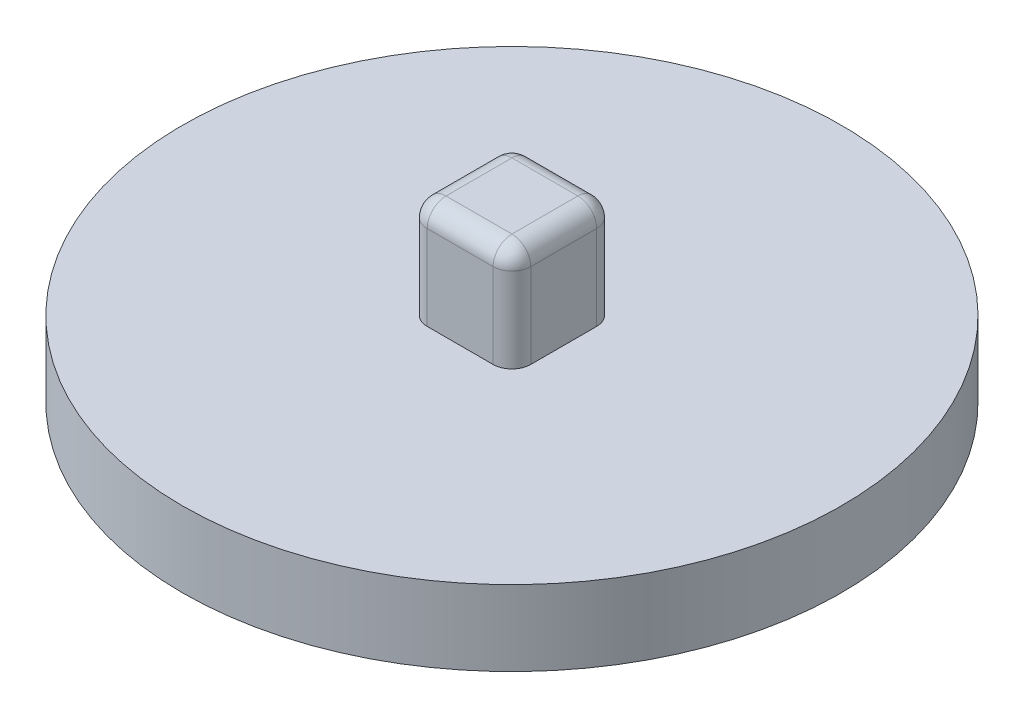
ISO-10303-21;
HEADER;
FILE_DESCRIPTION(('STEP AP214'),'2;1');
FILE_NAME('part.step','',(''),(''),'','','');
FILE_SCHEMA(('AUTOMOTIVE_DESIGN { 1 0 10303 214 1 1 1 1 }'));
ENDSEC;
DATA;
#1=APPLICATION_CONTEXT('core data for automotive mechanical design processes');
#2=APPLICATION_PROTOCOL_DEFINITION('international standard','automotive_design',2000,#1);
#3=PRODUCT_CONTEXT('',#1,'mechanical');
#4=PRODUCT('Part','Part','',(#3));
#5=PRODUCT_RELATED_PRODUCT_CATEGORY('part','',(#4));
#6=PRODUCT_DEFINITION_FORMATION('','',#4);
#7=PRODUCT_DEFINITION_CONTEXT('part definition',#1,'design');
#8=PRODUCT_DEFINITION('design','',#6,#7);
#9=PRODUCT_DEFINITION_SHAPE('','',#8);
#10=(LENGTH_UNIT() NAMED_UNIT(*) SI_UNIT(.MILLI.,.METRE.));
#11=(NAMED_UNIT(*) PLANE_ANGLE_UNIT() SI_UNIT($,.RADIAN.));
#12=(NAMED_UNIT(*) SI_UNIT($,.STERADIAN.) SOLID_ANGLE_UNIT());
#13=UNCERTAINTY_MEASURE_WITH_UNIT(LENGTH_MEASURE(1.E-05),#10,'distance_accuracy_value','');
#14=(GEOMETRIC_REPRESENTATION_CONTEXT(3) GLOBAL_UNCERTAINTY_ASSIGNED_CONTEXT((#13)) GLOBAL_UNIT_ASSIGNED_CONTEXT((#10,
#11,#12)) REPRESENTATION_CONTEXT('',''));
#15=CARTESIAN_POINT('',(0.,0.,0.));
#16=DIRECTION('',(0.,0.,1.));
#17=DIRECTION('',(1.,0.,0.));
#18=AXIS2_PLACEMENT_3D('',#15,#16,#17);
#19=CARTESIAN_POINT('',(0.,8.,0.));
#20=DIRECTION('',(0.,-1.,0.));
#21=DIRECTION('',(0.,0.,-1.));
#22=AXIS2_PLACEMENT_3D('',#19,#20,#21);
#23=CYLINDRICAL_SURFACE('',#22,35.);
#24=CARTESIAN_POINT('',(0.,8.,0.));
#25=DIRECTION('',(0.,1.,0.));
#26=DIRECTION('',(0.,0.,1.));
#27=AXIS2_PLACEMENT_3D('',#24,#25,#26);
#28=CIRCLE('',#27,35.);
#29=CARTESIAN_POINT('',(0.,8.,35.));
#30=VERTEX_POINT('',#29);
#31=EDGE_CURVE('E142',#30,#30,#28,.T.);
#32=ORIENTED_EDGE('',*,*,#31,.F.);
#33=EDGE_LOOP('',(#32));
#34=FACE_BOUND('',#33,.T.);
#35=CARTESIAN_POINT('',(0.,0.,0.));
#36=DIRECTION('',(0.,1.,0.));
#37=DIRECTION('',(0.,0.,1.));
#38=AXIS2_PLACEMENT_3D('',#35,#36,#37);
#39=CIRCLE('',#38,35.);
#40=CARTESIAN_POINT('',(0.,0.,35.));
#41=VERTEX_POINT('',#40);
#42=EDGE_CURVE('E214',#41,#41,#39,.T.);
#43=ORIENTED_EDGE('',*,*,#42,.T.);
#44=EDGE_LOOP('',(#43));
#45=FACE_BOUND('',#44,.T.);
#46=ADVANCED_FACE('F35',(#34,#45),#23,.T.);
#47=CARTESIAN_POINT('',(0.,8.,0.));
#48=DIRECTION('',(0.,1.,0.));
#49=DIRECTION('',(0.,0.,1.));
#50=AXIS2_PLACEMENT_3D('',#47,#48,#49);
#51=PLANE('',#50);
#52=DIRECTION('',(0.,0.,-1.));
#53=VECTOR('',#52,1.);
#54=CARTESIAN_POINT('',(5.5,8.,5.5));
#55=LINE('',#54,#53);
#56=CARTESIAN_POINT('',(5.5,8.,3.5));
#57=VERTEX_POINT('',#56);
#58=CARTESIAN_POINT('',(5.5,8.,-3.5));
#59=VERTEX_POINT('',#58);
#60=EDGE_CURVE('E200',#57,#59,#55,.T.);
#61=ORIENTED_EDGE('',*,*,#60,.F.);
#62=CARTESIAN_POINT('',(3.5,8.,3.5));
#63=DIRECTION('',(0.,1.,0.));
#64=DIRECTION('',(0.,0.,1.));
#65=AXIS2_PLACEMENT_3D('',#62,#63,#64);
#66=CIRCLE('',#65,2.);
#67=CARTESIAN_POINT('',(3.5,8.,5.5));
#68=VERTEX_POINT('',#67);
#69=EDGE_CURVE('E11',#57,#68,#66,.F.);
#70=ORIENTED_EDGE('',*,*,#69,.T.);
#71=DIRECTION('',(1.,0.,0.));
#72=VECTOR('',#71,1.);
#73=CARTESIAN_POINT('',(-5.5,8.,5.5));
#74=LINE('',#73,#72);
#75=CARTESIAN_POINT('',(-3.5,8.,5.5));
#76=VERTEX_POINT('',#75);
#77=EDGE_CURVE('E211',#76,#68,#74,.T.);
#78=ORIENTED_EDGE('',*,*,#77,.F.);
#79=CARTESIAN_POINT('',(-3.5,8.,3.5));
#80=DIRECTION('',(0.,1.,0.));
#81=DIRECTION('',(0.,0.,1.));
#82=AXIS2_PLACEMENT_3D('',#79,#80,#81);
#83=CIRCLE('',#82,2.);
#84=CARTESIAN_POINT('',(-5.5,8.,3.5));
#85=VERTEX_POINT('',#84);
#86=EDGE_CURVE('E44',#76,#85,#83,.F.);
#87=ORIENTED_EDGE('',*,*,#86,.T.);
#88=DIRECTION('',(0.,0.,1.));
#89=VECTOR('',#88,1.);
#90=CARTESIAN_POINT('',(-5.5,8.,5.5));
#91=LINE('',#90,#89);
#92=CARTESIAN_POINT('',(-5.5,8.,-3.5));
#93=VERTEX_POINT('',#92);
#94=EDGE_CURVE('E206',#93,#85,#91,.T.);
#95=ORIENTED_EDGE('',*,*,#94,.F.);
#96=CARTESIAN_POINT('',(-3.5,8.,-3.5));
#97=DIRECTION('',(0.,1.,0.));
#98=DIRECTION('',(0.,0.,1.));
#99=AXIS2_PLACEMENT_3D('',#96,#97,#98);
#100=CIRCLE('',#99,2.);
#101=CARTESIAN_POINT('',(-3.5,8.,-5.5));
#102=VERTEX_POINT('',#101);
#103=EDGE_CURVE('E175',#93,#102,#100,.F.);
#104=ORIENTED_EDGE('',*,*,#103,.T.);
#105=DIRECTION('',(-1.,0.,0.));
#106=VECTOR('',#105,1.);
#107=CARTESIAN_POINT('',(-5.5,8.,-5.5));
#108=LINE('',#107,#106);
#109=CARTESIAN_POINT('',(3.5,8.,-5.5));
#110=VERTEX_POINT('',#109);
#111=EDGE_CURVE('E202',#110,#102,#108,.T.);
#112=ORIENTED_EDGE('',*,*,#111,.F.);
#113=CARTESIAN_POINT('',(3.5,8.,-3.5));
#114=DIRECTION('',(0.,1.,0.));
#115=DIRECTION('',(0.,0.,1.));
#116=AXIS2_PLACEMENT_3D('',#113,#114,#115);
#117=CIRCLE('',#116,2.);
#118=EDGE_CURVE('E173',#110,#59,#117,.F.);
#119=ORIENTED_EDGE('',*,*,#118,.T.);
#120=EDGE_LOOP('',(#61,#70,#78,#87,#95,#104,#112,#119));
#121=FACE_BOUND('',#120,.T.);
#122=ORIENTED_EDGE('',*,*,#31,.T.);
#123=EDGE_LOOP('',(#122));
#124=FACE_BOUND('',#123,.T.);
#125=ADVANCED_FACE('F244',(#121,#124),#51,.T.);
#126=CARTESIAN_POINT('',(0.,0.,0.));
#127=DIRECTION('',(0.,1.,0.));
#128=DIRECTION('',(0.,0.,1.));
#129=AXIS2_PLACEMENT_3D('',#126,#127,#128);
#130=PLANE('',#129);
#131=ORIENTED_EDGE('',*,*,#42,.F.);
#132=EDGE_LOOP('',(#131));
#133=FACE_BOUND('',#132,.T.);
#134=ADVANCED_FACE('F267',(#133),#130,.F.);
#135=CARTESIAN_POINT('',(5.5,19.,5.5));
#136=DIRECTION('',(-1.,0.,0.));
#137=DIRECTION('',(0.,0.,1.));
#138=AXIS2_PLACEMENT_3D('',#135,#136,#137);
#139=PLANE('',#138);
#140=ORIENTED_EDGE('',*,*,#60,.T.);
#141=DIRECTION('',(0.,-1.,0.));
#142=VECTOR('',#141,1.);
#143=CARTESIAN_POINT('',(5.5,19.,-3.5));
#144=LINE('',#143,#142);
#145=CARTESIAN_POINT('',(5.5,17.,-3.5));
#146=VERTEX_POINT('',#145);
#147=EDGE_CURVE('E52',#59,#146,#144,.F.);
#148=ORIENTED_EDGE('',*,*,#147,.T.);
#149=DIRECTION('',(0.,0.,-1.));
#150=VECTOR('',#149,1.);
#151=CARTESIAN_POINT('',(5.5,17.,5.5));
#152=LINE('',#151,#150);
#153=CARTESIAN_POINT('',(5.5,17.,3.5));
#154=VERTEX_POINT('',#153);
#155=EDGE_CURVE('E57',#146,#154,#152,.F.);
#156=ORIENTED_EDGE('',*,*,#155,.T.);
#157=DIRECTION('',(0.,-1.,0.));
#158=VECTOR('',#157,1.);
#159=CARTESIAN_POINT('',(5.5,19.,3.5));
#160=LINE('',#159,#158);
#161=EDGE_CURVE('E169',#154,#57,#160,.T.);
#162=ORIENTED_EDGE('',*,*,#161,.T.);
#163=EDGE_LOOP('',(#140,#148,#156,#162));
#164=FACE_BOUND('',#163,.T.);
#165=ADVANCED_FACE('F242',(#164),#139,.F.);
#166=CARTESIAN_POINT('',(-5.5,19.,-5.5));
#167=DIRECTION('',(0.,0.,1.));
#168=DIRECTION('',(1.,0.,0.));
#169=AXIS2_PLACEMENT_3D('',#166,#167,#168);
#170=PLANE('',#169);
#171=DIRECTION('',(-1.,0.,0.));
#172=VECTOR('',#171,1.);
#173=CARTESIAN_POINT('',(-5.5,17.,-5.5));
#174=LINE('',#173,#172);
#175=CARTESIAN_POINT('',(-3.5,17.,-5.5));
#176=VERTEX_POINT('',#175);
#177=CARTESIAN_POINT('',(3.5,17.,-5.5));
#178=VERTEX_POINT('',#177);
#179=EDGE_CURVE('E165',#176,#178,#174,.F.);
#180=ORIENTED_EDGE('',*,*,#179,.T.);
#181=DIRECTION('',(0.,-1.,0.));
#182=VECTOR('',#181,1.);
#183=CARTESIAN_POINT('',(3.5,19.,-5.5));
#184=LINE('',#183,#182);
#185=EDGE_CURVE('E167',#178,#110,#184,.T.);
#186=ORIENTED_EDGE('',*,*,#185,.T.);
#187=ORIENTED_EDGE('',*,*,#111,.T.);
#188=DIRECTION('',(0.,-1.,0.));
#189=VECTOR('',#188,1.);
#190=CARTESIAN_POINT('',(-3.5,19.,-5.5));
#191=LINE('',#190,#189);
#192=EDGE_CURVE('E163',#102,#176,#191,.F.);
#193=ORIENTED_EDGE('',*,*,#192,.T.);
#194=EDGE_LOOP('',(#180,#186,#187,#193));
#195=FACE_BOUND('',#194,.T.);
#196=ADVANCED_FACE('F336',(#195),#170,.F.);
#197=CARTESIAN_POINT('',(-5.5,19.,5.5));
#198=DIRECTION('',(1.,0.,0.));
#199=DIRECTION('',(0.,0.,-1.));
#200=AXIS2_PLACEMENT_3D('',#197,#198,#199);
#201=PLANE('',#200);
#202=DIRECTION('',(0.,0.,1.));
#203=VECTOR('',#202,1.);
#204=CARTESIAN_POINT('',(-5.5,17.,5.5));
#205=LINE('',#204,#203);
#206=CARTESIAN_POINT('',(-5.5,17.,3.5));
#207=VERTEX_POINT('',#206);
#208=CARTESIAN_POINT('',(-5.5,17.,-3.5));
#209=VERTEX_POINT('',#208);
#210=EDGE_CURVE('E159',#207,#209,#205,.F.);
#211=ORIENTED_EDGE('',*,*,#210,.T.);
#212=DIRECTION('',(0.,-1.,0.));
#213=VECTOR('',#212,1.);
#214=CARTESIAN_POINT('',(-5.5,19.,-3.5));
#215=LINE('',#214,#213);
#216=EDGE_CURVE('E161',#209,#93,#215,.T.);
#217=ORIENTED_EDGE('',*,*,#216,.T.);
#218=ORIENTED_EDGE('',*,*,#94,.T.);
#219=DIRECTION('',(0.,-1.,0.));
#220=VECTOR('',#219,1.);
#221=CARTESIAN_POINT('',(-5.5,19.,3.5));
#222=LINE('',#221,#220);
#223=EDGE_CURVE('E157',#85,#207,#222,.F.);
#224=ORIENTED_EDGE('',*,*,#223,.T.);
#225=EDGE_LOOP('',(#211,#217,#218,#224));
#226=FACE_BOUND('',#225,.T.);
#227=ADVANCED_FACE('F327',(#226),#201,.F.);
#228=CARTESIAN_POINT('',(-5.5,19.,5.5));
#229=DIRECTION('',(0.,0.,-1.));
#230=DIRECTION('',(-1.,0.,0.));
#231=AXIS2_PLACEMENT_3D('',#228,#229,#230);
#232=PLANE('',#231);
#233=DIRECTION('',(1.,0.,0.));
#234=VECTOR('',#233,1.);
#235=CARTESIAN_POINT('',(-5.5,17.,5.5));
#236=LINE('',#235,#234);
#237=CARTESIAN_POINT('',(3.5,17.,5.5));
#238=VERTEX_POINT('',#237);
#239=CARTESIAN_POINT('',(-3.5,17.,5.5));
#240=VERTEX_POINT('',#239);
#241=EDGE_CURVE('E120',#238,#240,#236,.F.);
#242=ORIENTED_EDGE('',*,*,#241,.T.);
#243=DIRECTION('',(0.,-1.,0.));
#244=VECTOR('',#243,1.);
#245=CARTESIAN_POINT('',(-3.5,19.,5.5));
#246=LINE('',#245,#244);
#247=EDGE_CURVE('E155',#240,#76,#246,.T.);
#248=ORIENTED_EDGE('',*,*,#247,.T.);
#249=ORIENTED_EDGE('',*,*,#77,.T.);
#250=DIRECTION('',(0.,-1.,0.));
#251=VECTOR('',#250,1.);
#252=CARTESIAN_POINT('',(3.5,19.,5.5));
#253=LINE('',#252,#251);
#254=EDGE_CURVE('E148',#68,#238,#253,.F.);
#255=ORIENTED_EDGE('',*,*,#254,.T.);
#256=EDGE_LOOP('',(#242,#248,#249,#255));
#257=FACE_BOUND('',#256,.T.);
#258=ADVANCED_FACE('F237',(#257),#232,.F.);
#259=CARTESIAN_POINT('',(0.,19.,0.));
#260=DIRECTION('',(0.,-1.,0.));
#261=DIRECTION('',(0.,0.,-1.));
#262=AXIS2_PLACEMENT_3D('',#259,#260,#261);
#263=PLANE('',#262);
#264=DIRECTION('',(0.,0.,1.));
#265=VECTOR('',#264,1.);
#266=CARTESIAN_POINT('',(-3.5,19.,0.));
#267=LINE('',#266,#265);
#268=CARTESIAN_POINT('',(-3.5,19.,-3.5));
#269=VERTEX_POINT('',#268);
#270=CARTESIAN_POINT('',(-3.5,19.,3.5));
#271=VERTEX_POINT('',#270);
#272=EDGE_CURVE('E146',#269,#271,#267,.T.);
#273=ORIENTED_EDGE('',*,*,#272,.T.);
#274=DIRECTION('',(1.,0.,0.));
#275=VECTOR('',#274,1.);
#276=CARTESIAN_POINT('',(0.,19.,3.5));
#277=LINE('',#276,#275);
#278=CARTESIAN_POINT('',(3.5,19.,3.5));
#279=VERTEX_POINT('',#278);
#280=EDGE_CURVE('E118',#271,#279,#277,.T.);
#281=ORIENTED_EDGE('',*,*,#280,.T.);
#282=DIRECTION('',(0.,0.,-1.));
#283=VECTOR('',#282,1.);
#284=CARTESIAN_POINT('',(3.5,19.,0.));
#285=LINE('',#284,#283);
#286=CARTESIAN_POINT('',(3.5,19.,-3.5));
#287=VERTEX_POINT('',#286);
#288=EDGE_CURVE('E135',#279,#287,#285,.T.);
#289=ORIENTED_EDGE('',*,*,#288,.T.);
#290=DIRECTION('',(-1.,0.,0.));
#291=VECTOR('',#290,1.);
#292=CARTESIAN_POINT('',(0.,19.,-3.5));
#293=LINE('',#292,#291);
#294=EDGE_CURVE('E141',#287,#269,#293,.T.);
#295=ORIENTED_EDGE('',*,*,#294,.T.);
#296=EDGE_LOOP('',(#273,#281,#289,#295));
#297=FACE_BOUND('',#296,.T.);
#298=ADVANCED_FACE('F144',(#297),#263,.F.);
#299=CARTESIAN_POINT('',(-3.5,19.,-3.5));
#300=DIRECTION('',(0.,-1.,0.));
#301=DIRECTION('',(0.,0.,-1.));
#302=AXIS2_PLACEMENT_3D('',#299,#300,#301);
#303=CYLINDRICAL_SURFACE('',#302,2.);
#304=ORIENTED_EDGE('',*,*,#103,.F.);
#305=ORIENTED_EDGE('',*,*,#216,.F.);
#306=CARTESIAN_POINT('',(-3.5,17.,-3.5));
#307=DIRECTION('',(0.,1.,0.));
#308=DIRECTION('',(0.,0.,1.));
#309=AXIS2_PLACEMENT_3D('',#306,#307,#308);
#310=CIRCLE('',#309,2.);
#311=EDGE_CURVE('E39',#176,#209,#310,.T.);
#312=ORIENTED_EDGE('',*,*,#311,.F.);
#313=ORIENTED_EDGE('',*,*,#192,.F.);
#314=EDGE_LOOP('',(#304,#305,#312,#313));
#315=FACE_BOUND('',#314,.T.);
#316=ADVANCED_FACE('F37',(#315),#303,.T.);
#317=CARTESIAN_POINT('',(0.,17.,-3.5));
#318=DIRECTION('',(-1.,0.,0.));
#319=DIRECTION('',(0.,0.,1.));
#320=AXIS2_PLACEMENT_3D('',#317,#318,#319);
#321=CYLINDRICAL_SURFACE('',#320,2.);
#322=CARTESIAN_POINT('',(3.5,17.,-3.5));
#323=DIRECTION('',(1.,0.,0.));
#324=DIRECTION('',(0.,0.,-1.));
#325=AXIS2_PLACEMENT_3D('',#322,#323,#324);
#326=CIRCLE('',#325,2.);
#327=EDGE_CURVE('E192',#178,#287,#326,.T.);
#328=ORIENTED_EDGE('',*,*,#327,.F.);
#329=ORIENTED_EDGE('',*,*,#179,.F.);
#330=CARTESIAN_POINT('',(-3.5,17.,-3.5));
#331=DIRECTION('',(-1.,0.,0.));
#332=DIRECTION('',(0.,0.,1.));
#333=AXIS2_PLACEMENT_3D('',#330,#331,#332);
#334=CIRCLE('',#333,2.);
#335=EDGE_CURVE('E194',#269,#176,#334,.T.);
#336=ORIENTED_EDGE('',*,*,#335,.F.);
#337=ORIENTED_EDGE('',*,*,#294,.F.);
#338=EDGE_LOOP('',(#328,#329,#336,#337));
#339=FACE_BOUND('',#338,.T.);
#340=ADVANCED_FACE('F221',(#339),#321,.T.);
#341=CARTESIAN_POINT('',(3.5,19.,-3.5));
#342=DIRECTION('',(0.,-1.,0.));
#343=DIRECTION('',(0.,0.,-1.));
#344=AXIS2_PLACEMENT_3D('',#341,#342,#343);
#345=CYLINDRICAL_SURFACE('',#344,2.);
#346=ORIENTED_EDGE('',*,*,#118,.F.);
#347=ORIENTED_EDGE('',*,*,#185,.F.);
#348=CARTESIAN_POINT('',(3.5,17.,-3.5));
#349=DIRECTION('',(0.,1.,0.));
#350=DIRECTION('',(0.,0.,1.));
#351=AXIS2_PLACEMENT_3D('',#348,#349,#350);
#352=CIRCLE('',#351,2.);
#353=EDGE_CURVE('E189',#146,#178,#352,.T.);
#354=ORIENTED_EDGE('',*,*,#353,.F.);
#355=ORIENTED_EDGE('',*,*,#147,.F.);
#356=EDGE_LOOP('',(#346,#347,#354,#355));
#357=FACE_BOUND('',#356,.T.);
#358=ADVANCED_FACE('F250',(#357),#345,.T.);
#359=CARTESIAN_POINT('',(-3.5,17.,-3.5));
#360=DIRECTION('',(0.,0.,1.));
#361=DIRECTION('',(1.,0.,0.));
#362=AXIS2_PLACEMENT_3D('',#359,#360,#361);
#363=SPHERICAL_SURFACE('',#362,2.);
#364=ORIENTED_EDGE('',*,*,#335,.T.);
#365=ORIENTED_EDGE('',*,*,#311,.T.);
#366=CARTESIAN_POINT('',(-3.5,17.,-3.5));
#367=DIRECTION('',(0.,0.,-1.));
#368=DIRECTION('',(-1.,0.,0.));
#369=AXIS2_PLACEMENT_3D('',#366,#367,#368);
#370=CIRCLE('',#369,2.);
#371=EDGE_CURVE('E186',#269,#209,#370,.F.);
#372=ORIENTED_EDGE('',*,*,#371,.F.);
#373=EDGE_LOOP('',(#364,#365,#372));
#374=FACE_BOUND('',#373,.T.);
#375=ADVANCED_FACE('F222',(#374),#363,.T.);
#376=CARTESIAN_POINT('',(3.5,17.,-3.5));
#377=DIRECTION('',(0.,0.,1.));
#378=DIRECTION('',(1.,0.,0.));
#379=AXIS2_PLACEMENT_3D('',#376,#377,#378);
#380=SPHERICAL_SURFACE('',#379,2.);
#381=ORIENTED_EDGE('',*,*,#353,.T.);
#382=ORIENTED_EDGE('',*,*,#327,.T.);
#383=CARTESIAN_POINT('',(3.5,17.,-3.5));
#384=DIRECTION('',(0.,0.,-1.));
#385=DIRECTION('',(-1.,0.,0.));
#386=AXIS2_PLACEMENT_3D('',#383,#384,#385);
#387=CIRCLE('',#386,2.);
#388=EDGE_CURVE('E138',#146,#287,#387,.F.);
#389=ORIENTED_EDGE('',*,*,#388,.F.);
#390=EDGE_LOOP('',(#381,#382,#389));
#391=FACE_BOUND('',#390,.T.);
#392=ADVANCED_FACE('F252',(#391),#380,.T.);
#393=CARTESIAN_POINT('',(-3.5,19.,3.5));
#394=DIRECTION('',(0.,-1.,0.));
#395=DIRECTION('',(0.,0.,-1.));
#396=AXIS2_PLACEMENT_3D('',#393,#394,#395);
#397=CYLINDRICAL_SURFACE('',#396,2.);
#398=ORIENTED_EDGE('',*,*,#86,.F.);
#399=ORIENTED_EDGE('',*,*,#247,.F.);
#400=CARTESIAN_POINT('',(-3.5,17.,3.5));
#401=DIRECTION('',(0.,1.,0.));
#402=DIRECTION('',(0.,0.,1.));
#403=AXIS2_PLACEMENT_3D('',#400,#401,#402);
#404=CIRCLE('',#403,2.);
#405=EDGE_CURVE('E182',#207,#240,#404,.T.);
#406=ORIENTED_EDGE('',*,*,#405,.F.);
#407=ORIENTED_EDGE('',*,*,#223,.F.);
#408=EDGE_LOOP('',(#398,#399,#406,#407));
#409=FACE_BOUND('',#408,.T.);
#410=ADVANCED_FACE('F234',(#409),#397,.T.);
#411=CARTESIAN_POINT('',(-3.5,17.,0.));
#412=DIRECTION('',(0.,0.,1.));
#413=DIRECTION('',(1.,0.,0.));
#414=AXIS2_PLACEMENT_3D('',#411,#412,#413);
#415=CYLINDRICAL_SURFACE('',#414,2.);
#416=ORIENTED_EDGE('',*,*,#371,.T.);
#417=ORIENTED_EDGE('',*,*,#210,.F.);
#418=CARTESIAN_POINT('',(-3.5,17.,3.5));
#419=DIRECTION('',(0.,0.,1.));
#420=DIRECTION('',(1.,0.,0.));
#421=AXIS2_PLACEMENT_3D('',#418,#419,#420);
#422=CIRCLE('',#421,2.);
#423=EDGE_CURVE('E132',#271,#207,#422,.T.);
#424=ORIENTED_EDGE('',*,*,#423,.F.);
#425=ORIENTED_EDGE('',*,*,#272,.F.);
#426=EDGE_LOOP('',(#416,#417,#424,#425));
#427=FACE_BOUND('',#426,.T.);
#428=ADVANCED_FACE('F225',(#427),#415,.T.);
#429=CARTESIAN_POINT('',(3.5,17.,0.));
#430=DIRECTION('',(0.,0.,-1.));
#431=DIRECTION('',(-1.,0.,0.));
#432=AXIS2_PLACEMENT_3D('',#429,#430,#431);
#433=CYLINDRICAL_SURFACE('',#432,2.);
#434=ORIENTED_EDGE('',*,*,#388,.T.);
#435=ORIENTED_EDGE('',*,*,#288,.F.);
#436=CARTESIAN_POINT('',(3.5,17.,3.5));
#437=DIRECTION('',(0.,0.,1.));
#438=DIRECTION('',(1.,0.,0.));
#439=AXIS2_PLACEMENT_3D('',#436,#437,#438);
#440=CIRCLE('',#439,2.);
#441=EDGE_CURVE('E126',#154,#279,#440,.T.);
#442=ORIENTED_EDGE('',*,*,#441,.F.);
#443=ORIENTED_EDGE('',*,*,#155,.F.);
#444=EDGE_LOOP('',(#434,#435,#442,#443));
#445=FACE_BOUND('',#444,.T.);
#446=ADVANCED_FACE('F136',(#445),#433,.T.);
#447=CARTESIAN_POINT('',(3.5,19.,3.5));
#448=DIRECTION('',(0.,-1.,0.));
#449=DIRECTION('',(0.,0.,-1.));
#450=AXIS2_PLACEMENT_3D('',#447,#448,#449);
#451=CYLINDRICAL_SURFACE('',#450,2.);
#452=ORIENTED_EDGE('',*,*,#69,.F.);
#453=ORIENTED_EDGE('',*,*,#161,.F.);
#454=CARTESIAN_POINT('',(3.5,17.,3.5));
#455=DIRECTION('',(0.,1.,0.));
#456=DIRECTION('',(0.,0.,1.));
#457=AXIS2_PLACEMENT_3D('',#454,#455,#456);
#458=CIRCLE('',#457,2.);
#459=EDGE_CURVE('E130',#238,#154,#458,.T.);
#460=ORIENTED_EDGE('',*,*,#459,.F.);
#461=ORIENTED_EDGE('',*,*,#254,.F.);
#462=EDGE_LOOP('',(#452,#453,#460,#461));
#463=FACE_BOUND('',#462,.T.);
#464=ADVANCED_FACE('F241',(#463),#451,.T.);
#465=CARTESIAN_POINT('',(-3.5,17.,3.5));
#466=DIRECTION('',(0.,0.,1.));
#467=DIRECTION('',(1.,0.,0.));
#468=AXIS2_PLACEMENT_3D('',#465,#466,#467);
#469=SPHERICAL_SURFACE('',#468,2.);
#470=ORIENTED_EDGE('',*,*,#423,.T.);
#471=ORIENTED_EDGE('',*,*,#405,.T.);
#472=CARTESIAN_POINT('',(-3.5,17.,3.5));
#473=DIRECTION('',(-1.,0.,0.));
#474=DIRECTION('',(0.,0.,1.));
#475=AXIS2_PLACEMENT_3D('',#472,#473,#474);
#476=CIRCLE('',#475,2.);
#477=EDGE_CURVE('E123',#271,#240,#476,.F.);
#478=ORIENTED_EDGE('',*,*,#477,.F.);
#479=EDGE_LOOP('',(#470,#471,#478));
#480=FACE_BOUND('',#479,.T.);
#481=ADVANCED_FACE('F229',(#480),#469,.T.);
#482=CARTESIAN_POINT('',(3.5,17.,3.5));
#483=DIRECTION('',(0.,0.,1.));
#484=DIRECTION('',(1.,0.,0.));
#485=AXIS2_PLACEMENT_3D('',#482,#483,#484);
#486=SPHERICAL_SURFACE('',#485,2.);
#487=ORIENTED_EDGE('',*,*,#459,.T.);
#488=ORIENTED_EDGE('',*,*,#441,.T.);
#489=CARTESIAN_POINT('',(3.5,17.,3.5));
#490=DIRECTION('',(1.,0.,0.));
#491=DIRECTION('',(0.,0.,-1.));
#492=AXIS2_PLACEMENT_3D('',#489,#490,#491);
#493=CIRCLE('',#492,2.);
#494=EDGE_CURVE('E114',#238,#279,#493,.F.);
#495=ORIENTED_EDGE('',*,*,#494,.F.);
#496=EDGE_LOOP('',(#487,#488,#495));
#497=FACE_BOUND('',#496,.T.);
#498=ADVANCED_FACE('F128',(#497),#486,.T.);
#499=CARTESIAN_POINT('',(0.,17.,3.5));
#500=DIRECTION('',(1.,0.,0.));
#501=DIRECTION('',(0.,0.,-1.));
#502=AXIS2_PLACEMENT_3D('',#499,#500,#501);
#503=CYLINDRICAL_SURFACE('',#502,2.);
#504=ORIENTED_EDGE('',*,*,#477,.T.);
#505=ORIENTED_EDGE('',*,*,#241,.F.);
#506=ORIENTED_EDGE('',*,*,#494,.T.);
#507=ORIENTED_EDGE('',*,*,#280,.F.);
#508=EDGE_LOOP('',(#504,#505,#506,#507));
#509=FACE_BOUND('',#508,.T.);
#510=ADVANCED_FACE('F116',(#509),#503,.T.);
#511=CLOSED_SHELL('',(#46,#125,#134,#165,#196,#227,#258,#298,#316,#340,#358,#375,#392,#410,#428,
#446,#464,#481,#498,#510));
#512=MANIFOLD_SOLID_BREP('B2',#511);
#513=ADVANCED_BREP_SHAPE_REPRESENTATION('',(#18,#512),#14);
#514=SHAPE_DEFINITION_REPRESENTATION(#9,#513);
ENDSEC;
END-ISO-10303-21;
